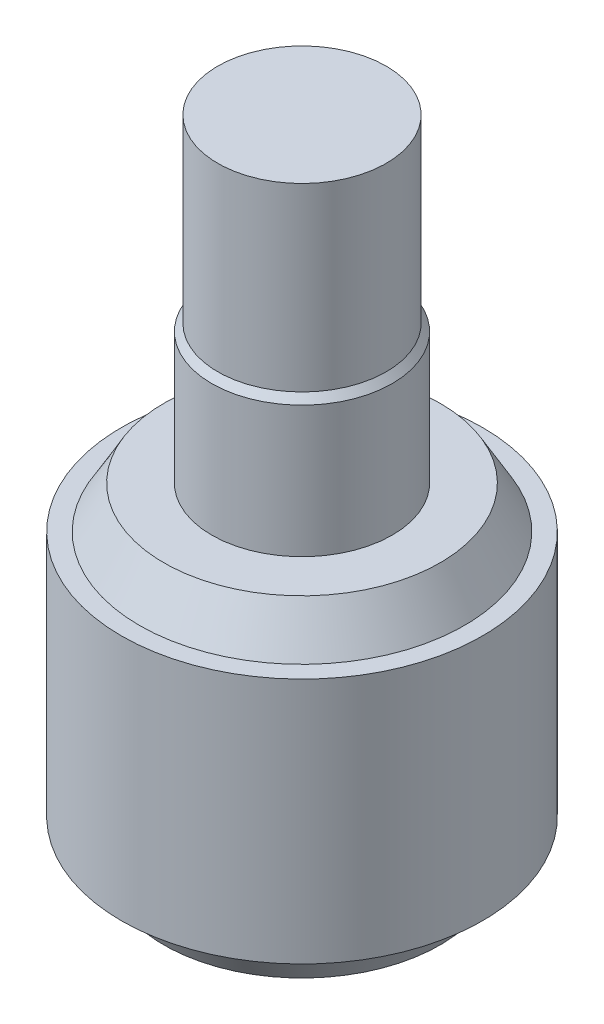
from build123d import *


with BuildPart() as part:
    # Sketch1 → Revolve1 (revolve)
    with BuildSketch(Plane.XY, mode=Mode.PRIVATE) as revolve1_sk:
        Polygon((0, 0), (2.295854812, 0), (2.7, 0.7), (3, 0.7), (3, 4.8), (2.7, 4.8), (2.295854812, 5.5), (1.5, 5.5), (1.5, 7.680824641), (1.4, 7.8), (1.4, 10.8), (0, 10.8), align=None)
    revolve(revolve1_sk.sketch.rotate(Axis((0, 0, 0), (0, 1, 0)), 90), axis=Axis((0, 0, 0), (0, 1, 0)))


solid = part.part
